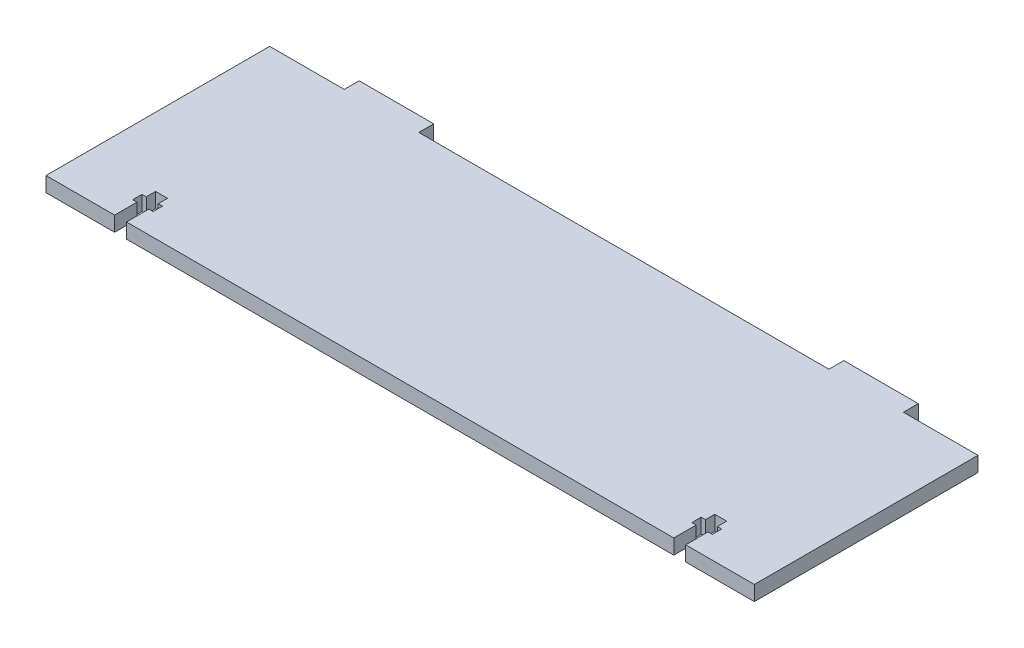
ISO-10303-21;
HEADER;
FILE_DESCRIPTION(('STEP AP214'),'2;1');
FILE_NAME('part.step','',(''),(''),'','','');
FILE_SCHEMA(('AUTOMOTIVE_DESIGN { 1 0 10303 214 1 1 1 1 }'));
ENDSEC;
DATA;
#1=APPLICATION_CONTEXT('core data for automotive mechanical design processes');
#2=APPLICATION_PROTOCOL_DEFINITION('international standard','automotive_design',2000,#1);
#3=PRODUCT_CONTEXT('',#1,'mechanical');
#4=PRODUCT('Part','Part','',(#3));
#5=PRODUCT_RELATED_PRODUCT_CATEGORY('part','',(#4));
#6=PRODUCT_DEFINITION_FORMATION('','',#4);
#7=PRODUCT_DEFINITION_CONTEXT('part definition',#1,'design');
#8=PRODUCT_DEFINITION('design','',#6,#7);
#9=PRODUCT_DEFINITION_SHAPE('','',#8);
#10=(LENGTH_UNIT() NAMED_UNIT(*) SI_UNIT(.MILLI.,.METRE.));
#11=(NAMED_UNIT(*) PLANE_ANGLE_UNIT() SI_UNIT($,.RADIAN.));
#12=(NAMED_UNIT(*) SI_UNIT($,.STERADIAN.) SOLID_ANGLE_UNIT());
#13=UNCERTAINTY_MEASURE_WITH_UNIT(LENGTH_MEASURE(1.E-05),#10,'distance_accuracy_value','');
#14=(GEOMETRIC_REPRESENTATION_CONTEXT(3) GLOBAL_UNCERTAINTY_ASSIGNED_CONTEXT((#13)) GLOBAL_UNIT_ASSIGNED_CONTEXT((#10,
#11,#12)) REPRESENTATION_CONTEXT('',''));
#15=CARTESIAN_POINT('',(0.,0.,0.));
#16=DIRECTION('',(0.,0.,1.));
#17=DIRECTION('',(1.,0.,0.));
#18=AXIS2_PLACEMENT_3D('',#15,#16,#17);
#19=CARTESIAN_POINT('',(-95.,4.,-30.));
#20=DIRECTION('',(1.,0.,0.));
#21=DIRECTION('',(0.,0.,-1.));
#22=AXIS2_PLACEMENT_3D('',#19,#20,#21);
#23=PLANE('',#22);
#24=DIRECTION('',(0.,0.,1.));
#25=VECTOR('',#24,1.);
#26=CARTESIAN_POINT('',(-95.,0.,-30.));
#27=LINE('',#26,#25);
#28=CARTESIAN_POINT('',(-95.,0.,-30.));
#29=VERTEX_POINT('',#28);
#30=CARTESIAN_POINT('',(-95.,0.,30.));
#31=VERTEX_POINT('',#30);
#32=EDGE_CURVE('E297',#29,#31,#27,.T.);
#33=ORIENTED_EDGE('',*,*,#32,.T.);
#34=DIRECTION('',(0.,-1.,0.));
#35=VECTOR('',#34,1.);
#36=CARTESIAN_POINT('',(-95.,4.,30.));
#37=LINE('',#36,#35);
#38=CARTESIAN_POINT('',(-95.,4.,30.));
#39=VERTEX_POINT('',#38);
#40=EDGE_CURVE('E11',#39,#31,#37,.T.);
#41=ORIENTED_EDGE('',*,*,#40,.F.);
#42=DIRECTION('',(0.,0.,1.));
#43=VECTOR('',#42,1.);
#44=CARTESIAN_POINT('',(-95.,4.,-30.));
#45=LINE('',#44,#43);
#46=CARTESIAN_POINT('',(-95.,4.,-30.));
#47=VERTEX_POINT('',#46);
#48=EDGE_CURVE('E367',#47,#39,#45,.T.);
#49=ORIENTED_EDGE('',*,*,#48,.F.);
#50=DIRECTION('',(0.,-1.,0.));
#51=VECTOR('',#50,1.);
#52=CARTESIAN_POINT('',(-95.,4.,-30.));
#53=LINE('',#52,#51);
#54=EDGE_CURVE('E293',#47,#29,#53,.T.);
#55=ORIENTED_EDGE('',*,*,#54,.T.);
#56=EDGE_LOOP('',(#33,#41,#49,#55));
#57=FACE_BOUND('',#56,.T.);
#58=ADVANCED_FACE('F33',(#57),#23,.F.);
#59=CARTESIAN_POINT('',(-95.,4.,30.));
#60=DIRECTION('',(0.,0.,-1.));
#61=DIRECTION('',(-1.,0.,0.));
#62=AXIS2_PLACEMENT_3D('',#59,#60,#61);
#63=PLANE('',#62);
#64=DIRECTION('',(1.,0.,0.));
#65=VECTOR('',#64,1.);
#66=CARTESIAN_POINT('',(-95.,0.,30.));
#67=LINE('',#66,#65);
#68=CARTESIAN_POINT('',(-76.6,0.,30.));
#69=VERTEX_POINT('',#68);
#70=EDGE_CURVE('E300',#31,#69,#67,.T.);
#71=ORIENTED_EDGE('',*,*,#70,.T.);
#72=DIRECTION('',(0.,-1.,0.));
#73=VECTOR('',#72,1.);
#74=CARTESIAN_POINT('',(-76.6,4.,30.));
#75=LINE('',#74,#73);
#76=CARTESIAN_POINT('',(-76.6,4.,30.));
#77=VERTEX_POINT('',#76);
#78=EDGE_CURVE('E41',#77,#69,#75,.T.);
#79=ORIENTED_EDGE('',*,*,#78,.F.);
#80=DIRECTION('',(1.,0.,0.));
#81=VECTOR('',#80,1.);
#82=CARTESIAN_POINT('',(-95.,4.,30.));
#83=LINE('',#82,#81);
#84=EDGE_CURVE('E176',#39,#77,#83,.T.);
#85=ORIENTED_EDGE('',*,*,#84,.F.);
#86=ORIENTED_EDGE('',*,*,#40,.T.);
#87=EDGE_LOOP('',(#71,#79,#85,#86));
#88=FACE_BOUND('',#87,.T.);
#89=ADVANCED_FACE('F565',(#88),#63,.F.);
#90=CARTESIAN_POINT('',(-76.6,4.,24.));
#91=DIRECTION('',(-1.,0.,0.));
#92=DIRECTION('',(0.,0.,1.));
#93=AXIS2_PLACEMENT_3D('',#90,#91,#92);
#94=PLANE('',#93);
#95=DIRECTION('',(0.,0.,-1.));
#96=VECTOR('',#95,1.);
#97=CARTESIAN_POINT('',(-76.6,0.,24.));
#98=LINE('',#97,#96);
#99=CARTESIAN_POINT('',(-76.6,0.,24.));
#100=VERTEX_POINT('',#99);
#101=EDGE_CURVE('E302',#69,#100,#98,.T.);
#102=ORIENTED_EDGE('',*,*,#101,.T.);
#103=DIRECTION('',(0.,-1.,0.));
#104=VECTOR('',#103,1.);
#105=CARTESIAN_POINT('',(-76.6,4.,24.));
#106=LINE('',#105,#104);
#107=CARTESIAN_POINT('',(-76.6,4.,24.));
#108=VERTEX_POINT('',#107);
#109=EDGE_CURVE('E458',#108,#100,#106,.T.);
#110=ORIENTED_EDGE('',*,*,#109,.F.);
#111=DIRECTION('',(0.,0.,-1.));
#112=VECTOR('',#111,1.);
#113=CARTESIAN_POINT('',(-76.6,4.,24.));
#114=LINE('',#113,#112);
#115=EDGE_CURVE('E466',#77,#108,#114,.T.);
#116=ORIENTED_EDGE('',*,*,#115,.F.);
#117=ORIENTED_EDGE('',*,*,#78,.T.);
#118=EDGE_LOOP('',(#102,#110,#116,#117));
#119=FACE_BOUND('',#118,.T.);
#120=ADVANCED_FACE('F464',(#119),#94,.F.);
#121=CARTESIAN_POINT('',(-77.75,4.,24.));
#122=DIRECTION('',(0.,0.,1.));
#123=DIRECTION('',(1.,0.,0.));
#124=AXIS2_PLACEMENT_3D('',#121,#122,#123);
#125=PLANE('',#124);
#126=DIRECTION('',(-1.,0.,0.));
#127=VECTOR('',#126,1.);
#128=CARTESIAN_POINT('',(-77.75,0.,24.));
#129=LINE('',#128,#127);
#130=CARTESIAN_POINT('',(-77.75,0.,24.));
#131=VERTEX_POINT('',#130);
#132=EDGE_CURVE('E304',#100,#131,#129,.T.);
#133=ORIENTED_EDGE('',*,*,#132,.T.);
#134=DIRECTION('',(0.,-1.,0.));
#135=VECTOR('',#134,1.);
#136=CARTESIAN_POINT('',(-77.75,4.,24.));
#137=LINE('',#136,#135);
#138=CARTESIAN_POINT('',(-77.75,4.,24.));
#139=VERTEX_POINT('',#138);
#140=EDGE_CURVE('E455',#139,#131,#137,.T.);
#141=ORIENTED_EDGE('',*,*,#140,.F.);
#142=DIRECTION('',(-1.,0.,0.));
#143=VECTOR('',#142,1.);
#144=CARTESIAN_POINT('',(-77.75,4.,24.));
#145=LINE('',#144,#143);
#146=EDGE_CURVE('E484',#108,#139,#145,.T.);
#147=ORIENTED_EDGE('',*,*,#146,.F.);
#148=ORIENTED_EDGE('',*,*,#109,.T.);
#149=EDGE_LOOP('',(#133,#141,#147,#148));
#150=FACE_BOUND('',#149,.T.);
#151=ADVANCED_FACE('F475',(#150),#125,.F.);
#152=CARTESIAN_POINT('',(-77.75,4.,21.5));
#153=DIRECTION('',(-1.,0.,0.));
#154=DIRECTION('',(0.,0.,1.));
#155=AXIS2_PLACEMENT_3D('',#152,#153,#154);
#156=PLANE('',#155);
#157=DIRECTION('',(0.,0.,-1.));
#158=VECTOR('',#157,1.);
#159=CARTESIAN_POINT('',(-77.75,0.,21.5));
#160=LINE('',#159,#158);
#161=CARTESIAN_POINT('',(-77.75,0.,21.5));
#162=VERTEX_POINT('',#161);
#163=EDGE_CURVE('E306',#131,#162,#160,.T.);
#164=ORIENTED_EDGE('',*,*,#163,.T.);
#165=DIRECTION('',(0.,-1.,0.));
#166=VECTOR('',#165,1.);
#167=CARTESIAN_POINT('',(-77.75,4.,21.5));
#168=LINE('',#167,#166);
#169=CARTESIAN_POINT('',(-77.75,4.,21.5));
#170=VERTEX_POINT('',#169);
#171=EDGE_CURVE('E452',#170,#162,#168,.T.);
#172=ORIENTED_EDGE('',*,*,#171,.F.);
#173=DIRECTION('',(0.,0.,-1.));
#174=VECTOR('',#173,1.);
#175=CARTESIAN_POINT('',(-77.75,4.,21.5));
#176=LINE('',#175,#174);
#177=EDGE_CURVE('E481',#139,#170,#176,.T.);
#178=ORIENTED_EDGE('',*,*,#177,.F.);
#179=ORIENTED_EDGE('',*,*,#140,.T.);
#180=EDGE_LOOP('',(#164,#172,#178,#179));
#181=FACE_BOUND('',#180,.T.);
#182=ADVANCED_FACE('F479',(#181),#156,.F.);
#183=CARTESIAN_POINT('',(-77.75,4.,21.5));
#184=DIRECTION('',(0.,0.,-1.));
#185=DIRECTION('',(-1.,0.,0.));
#186=AXIS2_PLACEMENT_3D('',#183,#184,#185);
#187=PLANE('',#186);
#188=DIRECTION('',(1.,0.,0.));
#189=VECTOR('',#188,1.);
#190=CARTESIAN_POINT('',(-77.75,0.,21.5));
#191=LINE('',#190,#189);
#192=CARTESIAN_POINT('',(-76.6,0.,21.5));
#193=VERTEX_POINT('',#192);
#194=EDGE_CURVE('E308',#162,#193,#191,.T.);
#195=ORIENTED_EDGE('',*,*,#194,.T.);
#196=DIRECTION('',(0.,-1.,0.));
#197=VECTOR('',#196,1.);
#198=CARTESIAN_POINT('',(-76.6,4.,21.5));
#199=LINE('',#198,#197);
#200=CARTESIAN_POINT('',(-76.6,4.,21.5));
#201=VERTEX_POINT('',#200);
#202=EDGE_CURVE('E449',#201,#193,#199,.T.);
#203=ORIENTED_EDGE('',*,*,#202,.F.);
#204=DIRECTION('',(1.,0.,0.));
#205=VECTOR('',#204,1.);
#206=CARTESIAN_POINT('',(-77.75,4.,21.5));
#207=LINE('',#206,#205);
#208=EDGE_CURVE('E483',#170,#201,#207,.T.);
#209=ORIENTED_EDGE('',*,*,#208,.F.);
#210=ORIENTED_EDGE('',*,*,#171,.T.);
#211=EDGE_LOOP('',(#195,#203,#209,#210));
#212=FACE_BOUND('',#211,.T.);
#213=ADVANCED_FACE('F578',(#212),#187,.F.);
#214=CARTESIAN_POINT('',(-76.6,4.,19.));
#215=DIRECTION('',(-1.,0.,0.));
#216=DIRECTION('',(0.,0.,1.));
#217=AXIS2_PLACEMENT_3D('',#214,#215,#216);
#218=PLANE('',#217);
#219=DIRECTION('',(0.,0.,-1.));
#220=VECTOR('',#219,1.);
#221=CARTESIAN_POINT('',(-76.6,0.,19.));
#222=LINE('',#221,#220);
#223=CARTESIAN_POINT('',(-76.6,0.,19.));
#224=VERTEX_POINT('',#223);
#225=EDGE_CURVE('E310',#193,#224,#222,.T.);
#226=ORIENTED_EDGE('',*,*,#225,.T.);
#227=DIRECTION('',(0.,-1.,0.));
#228=VECTOR('',#227,1.);
#229=CARTESIAN_POINT('',(-76.6,4.,19.));
#230=LINE('',#229,#228);
#231=CARTESIAN_POINT('',(-76.6,4.,19.));
#232=VERTEX_POINT('',#231);
#233=EDGE_CURVE('E446',#232,#224,#230,.T.);
#234=ORIENTED_EDGE('',*,*,#233,.F.);
#235=DIRECTION('',(0.,0.,-1.));
#236=VECTOR('',#235,1.);
#237=CARTESIAN_POINT('',(-76.6,4.,19.));
#238=LINE('',#237,#236);
#239=EDGE_CURVE('E486',#201,#232,#238,.T.);
#240=ORIENTED_EDGE('',*,*,#239,.F.);
#241=ORIENTED_EDGE('',*,*,#202,.T.);
#242=EDGE_LOOP('',(#226,#234,#240,#241));
#243=FACE_BOUND('',#242,.T.);
#244=ADVANCED_FACE('F581',(#243),#218,.F.);
#245=CARTESIAN_POINT('',(-76.6,4.,19.));
#246=DIRECTION('',(0.,0.,-1.));
#247=DIRECTION('',(-1.,0.,0.));
#248=AXIS2_PLACEMENT_3D('',#245,#246,#247);
#249=PLANE('',#248);
#250=DIRECTION('',(1.,0.,0.));
#251=VECTOR('',#250,1.);
#252=CARTESIAN_POINT('',(-76.6,0.,19.));
#253=LINE('',#252,#251);
#254=CARTESIAN_POINT('',(-73.4,0.,19.));
#255=VERTEX_POINT('',#254);
#256=EDGE_CURVE('E312',#224,#255,#253,.T.);
#257=ORIENTED_EDGE('',*,*,#256,.T.);
#258=DIRECTION('',(0.,-1.,0.));
#259=VECTOR('',#258,1.);
#260=CARTESIAN_POINT('',(-73.4,4.,19.));
#261=LINE('',#260,#259);
#262=CARTESIAN_POINT('',(-73.4,4.,19.));
#263=VERTEX_POINT('',#262);
#264=EDGE_CURVE('E443',#263,#255,#261,.T.);
#265=ORIENTED_EDGE('',*,*,#264,.F.);
#266=DIRECTION('',(1.,0.,0.));
#267=VECTOR('',#266,1.);
#268=CARTESIAN_POINT('',(-76.6,4.,19.));
#269=LINE('',#268,#267);
#270=EDGE_CURVE('E492',#232,#263,#269,.T.);
#271=ORIENTED_EDGE('',*,*,#270,.F.);
#272=ORIENTED_EDGE('',*,*,#233,.T.);
#273=EDGE_LOOP('',(#257,#265,#271,#272));
#274=FACE_BOUND('',#273,.T.);
#275=ADVANCED_FACE('F585',(#274),#249,.F.);
#276=CARTESIAN_POINT('',(-73.4,4.,19.));
#277=DIRECTION('',(1.,0.,0.));
#278=DIRECTION('',(0.,0.,-1.));
#279=AXIS2_PLACEMENT_3D('',#276,#277,#278);
#280=PLANE('',#279);
#281=DIRECTION('',(0.,0.,1.));
#282=VECTOR('',#281,1.);
#283=CARTESIAN_POINT('',(-73.4,0.,19.));
#284=LINE('',#283,#282);
#285=CARTESIAN_POINT('',(-73.4,0.,21.5));
#286=VERTEX_POINT('',#285);
#287=EDGE_CURVE('E314',#255,#286,#284,.T.);
#288=ORIENTED_EDGE('',*,*,#287,.T.);
#289=DIRECTION('',(0.,-1.,0.));
#290=VECTOR('',#289,1.);
#291=CARTESIAN_POINT('',(-73.4,4.,21.5));
#292=LINE('',#291,#290);
#293=CARTESIAN_POINT('',(-73.4,4.,21.5));
#294=VERTEX_POINT('',#293);
#295=EDGE_CURVE('E440',#294,#286,#292,.T.);
#296=ORIENTED_EDGE('',*,*,#295,.F.);
#297=DIRECTION('',(0.,0.,1.));
#298=VECTOR('',#297,1.);
#299=CARTESIAN_POINT('',(-73.4,4.,19.));
#300=LINE('',#299,#298);
#301=EDGE_CURVE('E494',#263,#294,#300,.T.);
#302=ORIENTED_EDGE('',*,*,#301,.F.);
#303=ORIENTED_EDGE('',*,*,#264,.T.);
#304=EDGE_LOOP('',(#288,#296,#302,#303));
#305=FACE_BOUND('',#304,.T.);
#306=ADVANCED_FACE('F589',(#305),#280,.F.);
#307=CARTESIAN_POINT('',(-73.4,4.,21.5));
#308=DIRECTION('',(0.,0.,-1.));
#309=DIRECTION('',(-1.,0.,0.));
#310=AXIS2_PLACEMENT_3D('',#307,#308,#309);
#311=PLANE('',#310);
#312=DIRECTION('',(1.,0.,0.));
#313=VECTOR('',#312,1.);
#314=CARTESIAN_POINT('',(-73.4,0.,21.5));
#315=LINE('',#314,#313);
#316=CARTESIAN_POINT('',(-72.25,0.,21.5));
#317=VERTEX_POINT('',#316);
#318=EDGE_CURVE('E316',#286,#317,#315,.T.);
#319=ORIENTED_EDGE('',*,*,#318,.T.);
#320=DIRECTION('',(0.,-1.,0.));
#321=VECTOR('',#320,1.);
#322=CARTESIAN_POINT('',(-72.25,4.,21.5));
#323=LINE('',#322,#321);
#324=CARTESIAN_POINT('',(-72.25,4.,21.5));
#325=VERTEX_POINT('',#324);
#326=EDGE_CURVE('E437',#325,#317,#323,.T.);
#327=ORIENTED_EDGE('',*,*,#326,.F.);
#328=DIRECTION('',(1.,0.,0.));
#329=VECTOR('',#328,1.);
#330=CARTESIAN_POINT('',(-73.4,4.,21.5));
#331=LINE('',#330,#329);
#332=EDGE_CURVE('E496',#294,#325,#331,.T.);
#333=ORIENTED_EDGE('',*,*,#332,.F.);
#334=ORIENTED_EDGE('',*,*,#295,.T.);
#335=EDGE_LOOP('',(#319,#327,#333,#334));
#336=FACE_BOUND('',#335,.T.);
#337=ADVANCED_FACE('F593',(#336),#311,.F.);
#338=CARTESIAN_POINT('',(-72.25,4.,21.5));
#339=DIRECTION('',(1.,0.,0.));
#340=DIRECTION('',(0.,0.,-1.));
#341=AXIS2_PLACEMENT_3D('',#338,#339,#340);
#342=PLANE('',#341);
#343=DIRECTION('',(0.,0.,1.));
#344=VECTOR('',#343,1.);
#345=CARTESIAN_POINT('',(-72.25,0.,21.5));
#346=LINE('',#345,#344);
#347=CARTESIAN_POINT('',(-72.25,0.,24.));
#348=VERTEX_POINT('',#347);
#349=EDGE_CURVE('E318',#317,#348,#346,.T.);
#350=ORIENTED_EDGE('',*,*,#349,.T.);
#351=DIRECTION('',(0.,-1.,0.));
#352=VECTOR('',#351,1.);
#353=CARTESIAN_POINT('',(-72.25,4.,24.));
#354=LINE('',#353,#352);
#355=CARTESIAN_POINT('',(-72.25,4.,24.));
#356=VERTEX_POINT('',#355);
#357=EDGE_CURVE('E434',#356,#348,#354,.T.);
#358=ORIENTED_EDGE('',*,*,#357,.F.);
#359=DIRECTION('',(0.,0.,1.));
#360=VECTOR('',#359,1.);
#361=CARTESIAN_POINT('',(-72.25,4.,21.5));
#362=LINE('',#361,#360);
#363=EDGE_CURVE('E498',#325,#356,#362,.T.);
#364=ORIENTED_EDGE('',*,*,#363,.F.);
#365=ORIENTED_EDGE('',*,*,#326,.T.);
#366=EDGE_LOOP('',(#350,#358,#364,#365));
#367=FACE_BOUND('',#366,.T.);
#368=ADVANCED_FACE('F597',(#367),#342,.F.);
#369=CARTESIAN_POINT('',(-73.4,4.,24.));
#370=DIRECTION('',(0.,0.,1.));
#371=DIRECTION('',(1.,0.,0.));
#372=AXIS2_PLACEMENT_3D('',#369,#370,#371);
#373=PLANE('',#372);
#374=DIRECTION('',(-1.,0.,0.));
#375=VECTOR('',#374,1.);
#376=CARTESIAN_POINT('',(-73.4,0.,24.));
#377=LINE('',#376,#375);
#378=CARTESIAN_POINT('',(-73.4,0.,24.));
#379=VERTEX_POINT('',#378);
#380=EDGE_CURVE('E320',#348,#379,#377,.T.);
#381=ORIENTED_EDGE('',*,*,#380,.T.);
#382=DIRECTION('',(0.,-1.,0.));
#383=VECTOR('',#382,1.);
#384=CARTESIAN_POINT('',(-73.4,4.,24.));
#385=LINE('',#384,#383);
#386=CARTESIAN_POINT('',(-73.4,4.,24.));
#387=VERTEX_POINT('',#386);
#388=EDGE_CURVE('E431',#387,#379,#385,.T.);
#389=ORIENTED_EDGE('',*,*,#388,.F.);
#390=DIRECTION('',(-1.,0.,0.));
#391=VECTOR('',#390,1.);
#392=CARTESIAN_POINT('',(-73.4,4.,24.));
#393=LINE('',#392,#391);
#394=EDGE_CURVE('E500',#356,#387,#393,.T.);
#395=ORIENTED_EDGE('',*,*,#394,.F.);
#396=ORIENTED_EDGE('',*,*,#357,.T.);
#397=EDGE_LOOP('',(#381,#389,#395,#396));
#398=FACE_BOUND('',#397,.T.);
#399=ADVANCED_FACE('F601',(#398),#373,.F.);
#400=CARTESIAN_POINT('',(-73.4,4.,24.));
#401=DIRECTION('',(1.,0.,0.));
#402=DIRECTION('',(0.,0.,-1.));
#403=AXIS2_PLACEMENT_3D('',#400,#401,#402);
#404=PLANE('',#403);
#405=DIRECTION('',(0.,0.,1.));
#406=VECTOR('',#405,1.);
#407=CARTESIAN_POINT('',(-73.4,0.,24.));
#408=LINE('',#407,#406);
#409=CARTESIAN_POINT('',(-73.4,0.,30.));
#410=VERTEX_POINT('',#409);
#411=EDGE_CURVE('E322',#379,#410,#408,.T.);
#412=ORIENTED_EDGE('',*,*,#411,.T.);
#413=DIRECTION('',(0.,-1.,0.));
#414=VECTOR('',#413,1.);
#415=CARTESIAN_POINT('',(-73.4,4.,30.));
#416=LINE('',#415,#414);
#417=CARTESIAN_POINT('',(-73.4,4.,30.));
#418=VERTEX_POINT('',#417);
#419=EDGE_CURVE('E428',#418,#410,#416,.T.);
#420=ORIENTED_EDGE('',*,*,#419,.F.);
#421=DIRECTION('',(0.,0.,1.));
#422=VECTOR('',#421,1.);
#423=CARTESIAN_POINT('',(-73.4,4.,24.));
#424=LINE('',#423,#422);
#425=EDGE_CURVE('E502',#387,#418,#424,.T.);
#426=ORIENTED_EDGE('',*,*,#425,.F.);
#427=ORIENTED_EDGE('',*,*,#388,.T.);
#428=EDGE_LOOP('',(#412,#420,#426,#427));
#429=FACE_BOUND('',#428,.T.);
#430=ADVANCED_FACE('F605',(#429),#404,.F.);
#431=CARTESIAN_POINT('',(-73.4,4.,30.));
#432=DIRECTION('',(0.,0.,-1.));
#433=DIRECTION('',(-1.,0.,0.));
#434=AXIS2_PLACEMENT_3D('',#431,#432,#433);
#435=PLANE('',#434);
#436=DIRECTION('',(1.,0.,0.));
#437=VECTOR('',#436,1.);
#438=CARTESIAN_POINT('',(-73.4,0.,30.));
#439=LINE('',#438,#437);
#440=CARTESIAN_POINT('',(73.4,0.,30.));
#441=VERTEX_POINT('',#440);
#442=EDGE_CURVE('E324',#410,#441,#439,.T.);
#443=ORIENTED_EDGE('',*,*,#442,.T.);
#444=DIRECTION('',(0.,-1.,0.));
#445=VECTOR('',#444,1.);
#446=CARTESIAN_POINT('',(73.4,4.,30.));
#447=LINE('',#446,#445);
#448=CARTESIAN_POINT('',(73.4,4.,30.));
#449=VERTEX_POINT('',#448);
#450=EDGE_CURVE('E425',#449,#441,#447,.T.);
#451=ORIENTED_EDGE('',*,*,#450,.F.);
#452=DIRECTION('',(1.,0.,0.));
#453=VECTOR('',#452,1.);
#454=CARTESIAN_POINT('',(-73.4,4.,30.));
#455=LINE('',#454,#453);
#456=EDGE_CURVE('E504',#418,#449,#455,.T.);
#457=ORIENTED_EDGE('',*,*,#456,.F.);
#458=ORIENTED_EDGE('',*,*,#419,.T.);
#459=EDGE_LOOP('',(#443,#451,#457,#458));
#460=FACE_BOUND('',#459,.T.);
#461=ADVANCED_FACE('F609',(#460),#435,.F.);
#462=CARTESIAN_POINT('',(73.4,4.,24.));
#463=DIRECTION('',(-1.,0.,0.));
#464=DIRECTION('',(0.,0.,1.));
#465=AXIS2_PLACEMENT_3D('',#462,#463,#464);
#466=PLANE('',#465);
#467=DIRECTION('',(0.,0.,-1.));
#468=VECTOR('',#467,1.);
#469=CARTESIAN_POINT('',(73.4,0.,24.));
#470=LINE('',#469,#468);
#471=CARTESIAN_POINT('',(73.4,0.,24.));
#472=VERTEX_POINT('',#471);
#473=EDGE_CURVE('E326',#441,#472,#470,.T.);
#474=ORIENTED_EDGE('',*,*,#473,.T.);
#475=DIRECTION('',(0.,-1.,0.));
#476=VECTOR('',#475,1.);
#477=CARTESIAN_POINT('',(73.4,4.,24.));
#478=LINE('',#477,#476);
#479=CARTESIAN_POINT('',(73.4,4.,24.));
#480=VERTEX_POINT('',#479);
#481=EDGE_CURVE('E422',#480,#472,#478,.T.);
#482=ORIENTED_EDGE('',*,*,#481,.F.);
#483=DIRECTION('',(0.,0.,-1.));
#484=VECTOR('',#483,1.);
#485=CARTESIAN_POINT('',(73.4,4.,24.));
#486=LINE('',#485,#484);
#487=EDGE_CURVE('E506',#449,#480,#486,.T.);
#488=ORIENTED_EDGE('',*,*,#487,.F.);
#489=ORIENTED_EDGE('',*,*,#450,.T.);
#490=EDGE_LOOP('',(#474,#482,#488,#489));
#491=FACE_BOUND('',#490,.T.);
#492=ADVANCED_FACE('F613',(#491),#466,.F.);
#493=CARTESIAN_POINT('',(73.4,4.,24.));
#494=DIRECTION('',(0.,0.,1.));
#495=DIRECTION('',(1.,0.,0.));
#496=AXIS2_PLACEMENT_3D('',#493,#494,#495);
#497=PLANE('',#496);
#498=DIRECTION('',(-1.,0.,0.));
#499=VECTOR('',#498,1.);
#500=CARTESIAN_POINT('',(73.4,0.,24.));
#501=LINE('',#500,#499);
#502=CARTESIAN_POINT('',(72.25,0.,24.));
#503=VERTEX_POINT('',#502);
#504=EDGE_CURVE('E328',#472,#503,#501,.T.);
#505=ORIENTED_EDGE('',*,*,#504,.T.);
#506=DIRECTION('',(0.,-1.,0.));
#507=VECTOR('',#506,1.);
#508=CARTESIAN_POINT('',(72.25,4.,24.));
#509=LINE('',#508,#507);
#510=CARTESIAN_POINT('',(72.25,4.,24.));
#511=VERTEX_POINT('',#510);
#512=EDGE_CURVE('E419',#511,#503,#509,.T.);
#513=ORIENTED_EDGE('',*,*,#512,.F.);
#514=DIRECTION('',(-1.,0.,0.));
#515=VECTOR('',#514,1.);
#516=CARTESIAN_POINT('',(73.4,4.,24.));
#517=LINE('',#516,#515);
#518=EDGE_CURVE('E508',#480,#511,#517,.T.);
#519=ORIENTED_EDGE('',*,*,#518,.F.);
#520=ORIENTED_EDGE('',*,*,#481,.T.);
#521=EDGE_LOOP('',(#505,#513,#519,#520));
#522=FACE_BOUND('',#521,.T.);
#523=ADVANCED_FACE('F617',(#522),#497,.F.);
#524=CARTESIAN_POINT('',(72.25,4.,21.5));
#525=DIRECTION('',(-1.,0.,0.));
#526=DIRECTION('',(0.,0.,1.));
#527=AXIS2_PLACEMENT_3D('',#524,#525,#526);
#528=PLANE('',#527);
#529=DIRECTION('',(0.,0.,-1.));
#530=VECTOR('',#529,1.);
#531=CARTESIAN_POINT('',(72.25,0.,21.5));
#532=LINE('',#531,#530);
#533=CARTESIAN_POINT('',(72.25,0.,21.5));
#534=VERTEX_POINT('',#533);
#535=EDGE_CURVE('E330',#503,#534,#532,.T.);
#536=ORIENTED_EDGE('',*,*,#535,.T.);
#537=DIRECTION('',(0.,-1.,0.));
#538=VECTOR('',#537,1.);
#539=CARTESIAN_POINT('',(72.25,4.,21.5));
#540=LINE('',#539,#538);
#541=CARTESIAN_POINT('',(72.25,4.,21.5));
#542=VERTEX_POINT('',#541);
#543=EDGE_CURVE('E416',#542,#534,#540,.T.);
#544=ORIENTED_EDGE('',*,*,#543,.F.);
#545=DIRECTION('',(0.,0.,-1.));
#546=VECTOR('',#545,1.);
#547=CARTESIAN_POINT('',(72.25,4.,21.5));
#548=LINE('',#547,#546);
#549=EDGE_CURVE('E510',#511,#542,#548,.T.);
#550=ORIENTED_EDGE('',*,*,#549,.F.);
#551=ORIENTED_EDGE('',*,*,#512,.T.);
#552=EDGE_LOOP('',(#536,#544,#550,#551));
#553=FACE_BOUND('',#552,.T.);
#554=ADVANCED_FACE('F621',(#553),#528,.F.);
#555=CARTESIAN_POINT('',(73.4,4.,21.5));
#556=DIRECTION('',(0.,0.,-1.));
#557=DIRECTION('',(-1.,0.,0.));
#558=AXIS2_PLACEMENT_3D('',#555,#556,#557);
#559=PLANE('',#558);
#560=DIRECTION('',(1.,0.,0.));
#561=VECTOR('',#560,1.);
#562=CARTESIAN_POINT('',(73.4,0.,21.5));
#563=LINE('',#562,#561);
#564=CARTESIAN_POINT('',(73.4,0.,21.5));
#565=VERTEX_POINT('',#564);
#566=EDGE_CURVE('E332',#534,#565,#563,.T.);
#567=ORIENTED_EDGE('',*,*,#566,.T.);
#568=DIRECTION('',(0.,-1.,0.));
#569=VECTOR('',#568,1.);
#570=CARTESIAN_POINT('',(73.4,4.,21.5));
#571=LINE('',#570,#569);
#572=CARTESIAN_POINT('',(73.4,4.,21.5));
#573=VERTEX_POINT('',#572);
#574=EDGE_CURVE('E413',#573,#565,#571,.T.);
#575=ORIENTED_EDGE('',*,*,#574,.F.);
#576=DIRECTION('',(1.,0.,0.));
#577=VECTOR('',#576,1.);
#578=CARTESIAN_POINT('',(73.4,4.,21.5));
#579=LINE('',#578,#577);
#580=EDGE_CURVE('E512',#542,#573,#579,.T.);
#581=ORIENTED_EDGE('',*,*,#580,.F.);
#582=ORIENTED_EDGE('',*,*,#543,.T.);
#583=EDGE_LOOP('',(#567,#575,#581,#582));
#584=FACE_BOUND('',#583,.T.);
#585=ADVANCED_FACE('F625',(#584),#559,.F.);
#586=CARTESIAN_POINT('',(73.4,4.,19.));
#587=DIRECTION('',(-1.,0.,0.));
#588=DIRECTION('',(0.,0.,1.));
#589=AXIS2_PLACEMENT_3D('',#586,#587,#588);
#590=PLANE('',#589);
#591=DIRECTION('',(0.,0.,-1.));
#592=VECTOR('',#591,1.);
#593=CARTESIAN_POINT('',(73.4,0.,19.));
#594=LINE('',#593,#592);
#595=CARTESIAN_POINT('',(73.4,0.,19.));
#596=VERTEX_POINT('',#595);
#597=EDGE_CURVE('E334',#565,#596,#594,.T.);
#598=ORIENTED_EDGE('',*,*,#597,.T.);
#599=DIRECTION('',(0.,-1.,0.));
#600=VECTOR('',#599,1.);
#601=CARTESIAN_POINT('',(73.4,4.,19.));
#602=LINE('',#601,#600);
#603=CARTESIAN_POINT('',(73.4,4.,19.));
#604=VERTEX_POINT('',#603);
#605=EDGE_CURVE('E410',#604,#596,#602,.T.);
#606=ORIENTED_EDGE('',*,*,#605,.F.);
#607=DIRECTION('',(0.,0.,-1.));
#608=VECTOR('',#607,1.);
#609=CARTESIAN_POINT('',(73.4,4.,19.));
#610=LINE('',#609,#608);
#611=EDGE_CURVE('E514',#573,#604,#610,.T.);
#612=ORIENTED_EDGE('',*,*,#611,.F.);
#613=ORIENTED_EDGE('',*,*,#574,.T.);
#614=EDGE_LOOP('',(#598,#606,#612,#613));
#615=FACE_BOUND('',#614,.T.);
#616=ADVANCED_FACE('F629',(#615),#590,.F.);
#617=CARTESIAN_POINT('',(76.6,4.,19.));
#618=DIRECTION('',(0.,0.,-1.));
#619=DIRECTION('',(-1.,0.,0.));
#620=AXIS2_PLACEMENT_3D('',#617,#618,#619);
#621=PLANE('',#620);
#622=DIRECTION('',(1.,0.,0.));
#623=VECTOR('',#622,1.);
#624=CARTESIAN_POINT('',(76.6,0.,19.));
#625=LINE('',#624,#623);
#626=CARTESIAN_POINT('',(76.6,0.,19.));
#627=VERTEX_POINT('',#626);
#628=EDGE_CURVE('E336',#596,#627,#625,.T.);
#629=ORIENTED_EDGE('',*,*,#628,.T.);
#630=DIRECTION('',(0.,-1.,0.));
#631=VECTOR('',#630,1.);
#632=CARTESIAN_POINT('',(76.6,4.,19.));
#633=LINE('',#632,#631);
#634=CARTESIAN_POINT('',(76.6,4.,19.));
#635=VERTEX_POINT('',#634);
#636=EDGE_CURVE('E407',#635,#627,#633,.T.);
#637=ORIENTED_EDGE('',*,*,#636,.F.);
#638=DIRECTION('',(1.,0.,0.));
#639=VECTOR('',#638,1.);
#640=CARTESIAN_POINT('',(76.6,4.,19.));
#641=LINE('',#640,#639);
#642=EDGE_CURVE('E516',#604,#635,#641,.T.);
#643=ORIENTED_EDGE('',*,*,#642,.F.);
#644=ORIENTED_EDGE('',*,*,#605,.T.);
#645=EDGE_LOOP('',(#629,#637,#643,#644));
#646=FACE_BOUND('',#645,.T.);
#647=ADVANCED_FACE('F633',(#646),#621,.F.);
#648=CARTESIAN_POINT('',(76.6,4.,19.));
#649=DIRECTION('',(1.,0.,0.));
#650=DIRECTION('',(0.,0.,-1.));
#651=AXIS2_PLACEMENT_3D('',#648,#649,#650);
#652=PLANE('',#651);
#653=DIRECTION('',(0.,0.,1.));
#654=VECTOR('',#653,1.);
#655=CARTESIAN_POINT('',(76.6,0.,19.));
#656=LINE('',#655,#654);
#657=CARTESIAN_POINT('',(76.6,0.,21.5));
#658=VERTEX_POINT('',#657);
#659=EDGE_CURVE('E338',#627,#658,#656,.T.);
#660=ORIENTED_EDGE('',*,*,#659,.T.);
#661=DIRECTION('',(0.,-1.,0.));
#662=VECTOR('',#661,1.);
#663=CARTESIAN_POINT('',(76.6,4.,21.5));
#664=LINE('',#663,#662);
#665=CARTESIAN_POINT('',(76.6,4.,21.5));
#666=VERTEX_POINT('',#665);
#667=EDGE_CURVE('E404',#666,#658,#664,.T.);
#668=ORIENTED_EDGE('',*,*,#667,.F.);
#669=DIRECTION('',(0.,0.,1.));
#670=VECTOR('',#669,1.);
#671=CARTESIAN_POINT('',(76.6,4.,19.));
#672=LINE('',#671,#670);
#673=EDGE_CURVE('E518',#635,#666,#672,.T.);
#674=ORIENTED_EDGE('',*,*,#673,.F.);
#675=ORIENTED_EDGE('',*,*,#636,.T.);
#676=EDGE_LOOP('',(#660,#668,#674,#675));
#677=FACE_BOUND('',#676,.T.);
#678=ADVANCED_FACE('F637',(#677),#652,.F.);
#679=CARTESIAN_POINT('',(77.75,4.,21.5));
#680=DIRECTION('',(0.,0.,-1.));
#681=DIRECTION('',(-1.,0.,0.));
#682=AXIS2_PLACEMENT_3D('',#679,#680,#681);
#683=PLANE('',#682);
#684=DIRECTION('',(1.,0.,0.));
#685=VECTOR('',#684,1.);
#686=CARTESIAN_POINT('',(77.75,0.,21.5));
#687=LINE('',#686,#685);
#688=CARTESIAN_POINT('',(77.75,0.,21.5));
#689=VERTEX_POINT('',#688);
#690=EDGE_CURVE('E340',#658,#689,#687,.T.);
#691=ORIENTED_EDGE('',*,*,#690,.T.);
#692=DIRECTION('',(0.,-1.,0.));
#693=VECTOR('',#692,1.);
#694=CARTESIAN_POINT('',(77.75,4.,21.5));
#695=LINE('',#694,#693);
#696=CARTESIAN_POINT('',(77.75,4.,21.5));
#697=VERTEX_POINT('',#696);
#698=EDGE_CURVE('E401',#697,#689,#695,.T.);
#699=ORIENTED_EDGE('',*,*,#698,.F.);
#700=DIRECTION('',(1.,0.,0.));
#701=VECTOR('',#700,1.);
#702=CARTESIAN_POINT('',(77.75,4.,21.5));
#703=LINE('',#702,#701);
#704=EDGE_CURVE('E520',#666,#697,#703,.T.);
#705=ORIENTED_EDGE('',*,*,#704,.F.);
#706=ORIENTED_EDGE('',*,*,#667,.T.);
#707=EDGE_LOOP('',(#691,#699,#705,#706));
#708=FACE_BOUND('',#707,.T.);
#709=ADVANCED_FACE('F641',(#708),#683,.F.);
#710=CARTESIAN_POINT('',(77.75,4.,21.5));
#711=DIRECTION('',(1.,0.,0.));
#712=DIRECTION('',(0.,0.,-1.));
#713=AXIS2_PLACEMENT_3D('',#710,#711,#712);
#714=PLANE('',#713);
#715=DIRECTION('',(0.,0.,1.));
#716=VECTOR('',#715,1.);
#717=CARTESIAN_POINT('',(77.75,0.,21.5));
#718=LINE('',#717,#716);
#719=CARTESIAN_POINT('',(77.75,0.,24.));
#720=VERTEX_POINT('',#719);
#721=EDGE_CURVE('E342',#689,#720,#718,.T.);
#722=ORIENTED_EDGE('',*,*,#721,.T.);
#723=DIRECTION('',(0.,-1.,0.));
#724=VECTOR('',#723,1.);
#725=CARTESIAN_POINT('',(77.75,4.,24.));
#726=LINE('',#725,#724);
#727=CARTESIAN_POINT('',(77.75,4.,24.));
#728=VERTEX_POINT('',#727);
#729=EDGE_CURVE('E398',#728,#720,#726,.T.);
#730=ORIENTED_EDGE('',*,*,#729,.F.);
#731=DIRECTION('',(0.,0.,1.));
#732=VECTOR('',#731,1.);
#733=CARTESIAN_POINT('',(77.75,4.,21.5));
#734=LINE('',#733,#732);
#735=EDGE_CURVE('E522',#697,#728,#734,.T.);
#736=ORIENTED_EDGE('',*,*,#735,.F.);
#737=ORIENTED_EDGE('',*,*,#698,.T.);
#738=EDGE_LOOP('',(#722,#730,#736,#737));
#739=FACE_BOUND('',#738,.T.);
#740=ADVANCED_FACE('F645',(#739),#714,.F.);
#741=CARTESIAN_POINT('',(77.75,4.,24.));
#742=DIRECTION('',(0.,0.,1.));
#743=DIRECTION('',(1.,0.,0.));
#744=AXIS2_PLACEMENT_3D('',#741,#742,#743);
#745=PLANE('',#744);
#746=DIRECTION('',(-1.,0.,0.));
#747=VECTOR('',#746,1.);
#748=CARTESIAN_POINT('',(77.75,0.,24.));
#749=LINE('',#748,#747);
#750=CARTESIAN_POINT('',(76.6,0.,24.));
#751=VERTEX_POINT('',#750);
#752=EDGE_CURVE('E344',#720,#751,#749,.T.);
#753=ORIENTED_EDGE('',*,*,#752,.T.);
#754=DIRECTION('',(0.,-1.,0.));
#755=VECTOR('',#754,1.);
#756=CARTESIAN_POINT('',(76.6,4.,24.));
#757=LINE('',#756,#755);
#758=CARTESIAN_POINT('',(76.6,4.,24.));
#759=VERTEX_POINT('',#758);
#760=EDGE_CURVE('E395',#759,#751,#757,.T.);
#761=ORIENTED_EDGE('',*,*,#760,.F.);
#762=DIRECTION('',(-1.,0.,0.));
#763=VECTOR('',#762,1.);
#764=CARTESIAN_POINT('',(77.75,4.,24.));
#765=LINE('',#764,#763);
#766=EDGE_CURVE('E524',#728,#759,#765,.T.);
#767=ORIENTED_EDGE('',*,*,#766,.F.);
#768=ORIENTED_EDGE('',*,*,#729,.T.);
#769=EDGE_LOOP('',(#753,#761,#767,#768));
#770=FACE_BOUND('',#769,.T.);
#771=ADVANCED_FACE('F649',(#770),#745,.F.);
#772=CARTESIAN_POINT('',(76.6,4.,24.));
#773=DIRECTION('',(1.,0.,0.));
#774=DIRECTION('',(0.,0.,-1.));
#775=AXIS2_PLACEMENT_3D('',#772,#773,#774);
#776=PLANE('',#775);
#777=DIRECTION('',(0.,0.,1.));
#778=VECTOR('',#777,1.);
#779=CARTESIAN_POINT('',(76.6,0.,24.));
#780=LINE('',#779,#778);
#781=CARTESIAN_POINT('',(76.6,0.,30.));
#782=VERTEX_POINT('',#781);
#783=EDGE_CURVE('E346',#751,#782,#780,.T.);
#784=ORIENTED_EDGE('',*,*,#783,.T.);
#785=DIRECTION('',(0.,-1.,0.));
#786=VECTOR('',#785,1.);
#787=CARTESIAN_POINT('',(76.6,4.,30.));
#788=LINE('',#787,#786);
#789=CARTESIAN_POINT('',(76.6,4.,30.));
#790=VERTEX_POINT('',#789);
#791=EDGE_CURVE('E392',#790,#782,#788,.T.);
#792=ORIENTED_EDGE('',*,*,#791,.F.);
#793=DIRECTION('',(0.,0.,1.));
#794=VECTOR('',#793,1.);
#795=CARTESIAN_POINT('',(76.6,4.,24.));
#796=LINE('',#795,#794);
#797=EDGE_CURVE('E526',#759,#790,#796,.T.);
#798=ORIENTED_EDGE('',*,*,#797,.F.);
#799=ORIENTED_EDGE('',*,*,#760,.T.);
#800=EDGE_LOOP('',(#784,#792,#798,#799));
#801=FACE_BOUND('',#800,.T.);
#802=ADVANCED_FACE('F653',(#801),#776,.F.);
#803=CARTESIAN_POINT('',(76.6,4.,30.));
#804=DIRECTION('',(0.,0.,-1.));
#805=DIRECTION('',(-1.,0.,0.));
#806=AXIS2_PLACEMENT_3D('',#803,#804,#805);
#807=PLANE('',#806);
#808=DIRECTION('',(1.,0.,0.));
#809=VECTOR('',#808,1.);
#810=CARTESIAN_POINT('',(76.6,0.,30.));
#811=LINE('',#810,#809);
#812=CARTESIAN_POINT('',(95.,0.,30.));
#813=VERTEX_POINT('',#812);
#814=EDGE_CURVE('E348',#782,#813,#811,.T.);
#815=ORIENTED_EDGE('',*,*,#814,.T.);
#816=DIRECTION('',(0.,-1.,0.));
#817=VECTOR('',#816,1.);
#818=CARTESIAN_POINT('',(95.,4.,30.));
#819=LINE('',#818,#817);
#820=CARTESIAN_POINT('',(95.,4.,30.));
#821=VERTEX_POINT('',#820);
#822=EDGE_CURVE('E389',#821,#813,#819,.T.);
#823=ORIENTED_EDGE('',*,*,#822,.F.);
#824=DIRECTION('',(1.,0.,0.));
#825=VECTOR('',#824,1.);
#826=CARTESIAN_POINT('',(76.6,4.,30.));
#827=LINE('',#826,#825);
#828=EDGE_CURVE('E528',#790,#821,#827,.T.);
#829=ORIENTED_EDGE('',*,*,#828,.F.);
#830=ORIENTED_EDGE('',*,*,#791,.T.);
#831=EDGE_LOOP('',(#815,#823,#829,#830));
#832=FACE_BOUND('',#831,.T.);
#833=ADVANCED_FACE('F657',(#832),#807,.F.);
#834=CARTESIAN_POINT('',(95.,4.,-30.));
#835=DIRECTION('',(-1.,0.,0.));
#836=DIRECTION('',(0.,0.,1.));
#837=AXIS2_PLACEMENT_3D('',#834,#835,#836);
#838=PLANE('',#837);
#839=DIRECTION('',(0.,0.,-1.));
#840=VECTOR('',#839,1.);
#841=CARTESIAN_POINT('',(95.,0.,-30.));
#842=LINE('',#841,#840);
#843=CARTESIAN_POINT('',(95.,0.,-30.));
#844=VERTEX_POINT('',#843);
#845=EDGE_CURVE('E350',#813,#844,#842,.T.);
#846=ORIENTED_EDGE('',*,*,#845,.T.);
#847=DIRECTION('',(0.,-1.,0.));
#848=VECTOR('',#847,1.);
#849=CARTESIAN_POINT('',(95.,4.,-30.));
#850=LINE('',#849,#848);
#851=CARTESIAN_POINT('',(95.,4.,-30.));
#852=VERTEX_POINT('',#851);
#853=EDGE_CURVE('E386',#852,#844,#850,.T.);
#854=ORIENTED_EDGE('',*,*,#853,.F.);
#855=DIRECTION('',(0.,0.,-1.));
#856=VECTOR('',#855,1.);
#857=CARTESIAN_POINT('',(95.,4.,-30.));
#858=LINE('',#857,#856);
#859=EDGE_CURVE('E530',#821,#852,#858,.T.);
#860=ORIENTED_EDGE('',*,*,#859,.F.);
#861=ORIENTED_EDGE('',*,*,#822,.T.);
#862=EDGE_LOOP('',(#846,#854,#860,#861));
#863=FACE_BOUND('',#862,.T.);
#864=ADVANCED_FACE('F661',(#863),#838,.F.);
#865=CARTESIAN_POINT('',(75.,4.,-30.));
#866=DIRECTION('',(0.,0.,1.));
#867=DIRECTION('',(1.,0.,0.));
#868=AXIS2_PLACEMENT_3D('',#865,#866,#867);
#869=PLANE('',#868);
#870=DIRECTION('',(-1.,0.,0.));
#871=VECTOR('',#870,1.);
#872=CARTESIAN_POINT('',(75.,0.,-30.));
#873=LINE('',#872,#871);
#874=CARTESIAN_POINT('',(75.,0.,-30.));
#875=VERTEX_POINT('',#874);
#876=EDGE_CURVE('E352',#844,#875,#873,.T.);
#877=ORIENTED_EDGE('',*,*,#876,.T.);
#878=DIRECTION('',(0.,-1.,0.));
#879=VECTOR('',#878,1.);
#880=CARTESIAN_POINT('',(75.,4.,-30.));
#881=LINE('',#880,#879);
#882=CARTESIAN_POINT('',(75.,4.,-30.));
#883=VERTEX_POINT('',#882);
#884=EDGE_CURVE('E383',#883,#875,#881,.T.);
#885=ORIENTED_EDGE('',*,*,#884,.F.);
#886=DIRECTION('',(-1.,0.,0.));
#887=VECTOR('',#886,1.);
#888=CARTESIAN_POINT('',(75.,4.,-30.));
#889=LINE('',#888,#887);
#890=EDGE_CURVE('E532',#852,#883,#889,.T.);
#891=ORIENTED_EDGE('',*,*,#890,.F.);
#892=ORIENTED_EDGE('',*,*,#853,.T.);
#893=EDGE_LOOP('',(#877,#885,#891,#892));
#894=FACE_BOUND('',#893,.T.);
#895=ADVANCED_FACE('F665',(#894),#869,.F.);
#896=CARTESIAN_POINT('',(75.,4.,-34.));
#897=DIRECTION('',(-1.,0.,0.));
#898=DIRECTION('',(0.,0.,1.));
#899=AXIS2_PLACEMENT_3D('',#896,#897,#898);
#900=PLANE('',#899);
#901=DIRECTION('',(0.,0.,-1.));
#902=VECTOR('',#901,1.);
#903=CARTESIAN_POINT('',(75.,0.,-34.));
#904=LINE('',#903,#902);
#905=CARTESIAN_POINT('',(75.,0.,-34.));
#906=VERTEX_POINT('',#905);
#907=EDGE_CURVE('E354',#875,#906,#904,.T.);
#908=ORIENTED_EDGE('',*,*,#907,.T.);
#909=DIRECTION('',(0.,-1.,0.));
#910=VECTOR('',#909,1.);
#911=CARTESIAN_POINT('',(75.,4.,-34.));
#912=LINE('',#911,#910);
#913=CARTESIAN_POINT('',(75.,4.,-34.));
#914=VERTEX_POINT('',#913);
#915=EDGE_CURVE('E380',#914,#906,#912,.T.);
#916=ORIENTED_EDGE('',*,*,#915,.F.);
#917=DIRECTION('',(0.,0.,-1.));
#918=VECTOR('',#917,1.);
#919=CARTESIAN_POINT('',(75.,4.,-34.));
#920=LINE('',#919,#918);
#921=EDGE_CURVE('E534',#883,#914,#920,.T.);
#922=ORIENTED_EDGE('',*,*,#921,.F.);
#923=ORIENTED_EDGE('',*,*,#884,.T.);
#924=EDGE_LOOP('',(#908,#916,#922,#923));
#925=FACE_BOUND('',#924,.T.);
#926=ADVANCED_FACE('F669',(#925),#900,.F.);
#927=CARTESIAN_POINT('',(75.,4.,-34.));
#928=DIRECTION('',(0.,0.,1.));
#929=DIRECTION('',(1.,0.,0.));
#930=AXIS2_PLACEMENT_3D('',#927,#928,#929);
#931=PLANE('',#930);
#932=DIRECTION('',(-1.,0.,0.));
#933=VECTOR('',#932,1.);
#934=CARTESIAN_POINT('',(75.,0.,-34.));
#935=LINE('',#934,#933);
#936=CARTESIAN_POINT('',(55.,0.,-34.));
#937=VERTEX_POINT('',#936);
#938=EDGE_CURVE('E356',#906,#937,#935,.T.);
#939=ORIENTED_EDGE('',*,*,#938,.T.);
#940=DIRECTION('',(0.,-1.,0.));
#941=VECTOR('',#940,1.);
#942=CARTESIAN_POINT('',(55.,4.,-34.));
#943=LINE('',#942,#941);
#944=CARTESIAN_POINT('',(55.,4.,-34.));
#945=VERTEX_POINT('',#944);
#946=EDGE_CURVE('E377',#945,#937,#943,.T.);
#947=ORIENTED_EDGE('',*,*,#946,.F.);
#948=DIRECTION('',(-1.,0.,0.));
#949=VECTOR('',#948,1.);
#950=CARTESIAN_POINT('',(75.,4.,-34.));
#951=LINE('',#950,#949);
#952=EDGE_CURVE('E536',#914,#945,#951,.T.);
#953=ORIENTED_EDGE('',*,*,#952,.F.);
#954=ORIENTED_EDGE('',*,*,#915,.T.);
#955=EDGE_LOOP('',(#939,#947,#953,#954));
#956=FACE_BOUND('',#955,.T.);
#957=ADVANCED_FACE('F673',(#956),#931,.F.);
#958=CARTESIAN_POINT('',(55.,4.,-34.));
#959=DIRECTION('',(1.,0.,0.));
#960=DIRECTION('',(0.,0.,-1.));
#961=AXIS2_PLACEMENT_3D('',#958,#959,#960);
#962=PLANE('',#961);
#963=DIRECTION('',(0.,0.,1.));
#964=VECTOR('',#963,1.);
#965=CARTESIAN_POINT('',(55.,0.,-34.));
#966=LINE('',#965,#964);
#967=CARTESIAN_POINT('',(55.,0.,-30.));
#968=VERTEX_POINT('',#967);
#969=EDGE_CURVE('E358',#937,#968,#966,.T.);
#970=ORIENTED_EDGE('',*,*,#969,.T.);
#971=DIRECTION('',(0.,-1.,0.));
#972=VECTOR('',#971,1.);
#973=CARTESIAN_POINT('',(55.,4.,-30.));
#974=LINE('',#973,#972);
#975=CARTESIAN_POINT('',(55.,4.,-30.));
#976=VERTEX_POINT('',#975);
#977=EDGE_CURVE('E374',#976,#968,#974,.T.);
#978=ORIENTED_EDGE('',*,*,#977,.F.);
#979=DIRECTION('',(0.,0.,1.));
#980=VECTOR('',#979,1.);
#981=CARTESIAN_POINT('',(55.,4.,-34.));
#982=LINE('',#981,#980);
#983=EDGE_CURVE('E538',#945,#976,#982,.T.);
#984=ORIENTED_EDGE('',*,*,#983,.F.);
#985=ORIENTED_EDGE('',*,*,#946,.T.);
#986=EDGE_LOOP('',(#970,#978,#984,#985));
#987=FACE_BOUND('',#986,.T.);
#988=ADVANCED_FACE('F677',(#987),#962,.F.);
#989=CARTESIAN_POINT('',(-55.,4.,-30.));
#990=DIRECTION('',(0.,0.,1.));
#991=DIRECTION('',(1.,0.,0.));
#992=AXIS2_PLACEMENT_3D('',#989,#990,#991);
#993=PLANE('',#992);
#994=DIRECTION('',(-1.,0.,0.));
#995=VECTOR('',#994,1.);
#996=CARTESIAN_POINT('',(-55.,0.,-30.));
#997=LINE('',#996,#995);
#998=CARTESIAN_POINT('',(-55.,0.,-30.));
#999=VERTEX_POINT('',#998);
#1000=EDGE_CURVE('E360',#968,#999,#997,.T.);
#1001=ORIENTED_EDGE('',*,*,#1000,.T.);
#1002=DIRECTION('',(0.,-1.,0.));
#1003=VECTOR('',#1002,1.);
#1004=CARTESIAN_POINT('',(-55.,4.,-30.));
#1005=LINE('',#1004,#1003);
#1006=CARTESIAN_POINT('',(-55.,4.,-30.));
#1007=VERTEX_POINT('',#1006);
#1008=EDGE_CURVE('E371',#1007,#999,#1005,.T.);
#1009=ORIENTED_EDGE('',*,*,#1008,.F.);
#1010=DIRECTION('',(-1.,0.,0.));
#1011=VECTOR('',#1010,1.);
#1012=CARTESIAN_POINT('',(-55.,4.,-30.));
#1013=LINE('',#1012,#1011);
#1014=EDGE_CURVE('E540',#976,#1007,#1013,.T.);
#1015=ORIENTED_EDGE('',*,*,#1014,.F.);
#1016=ORIENTED_EDGE('',*,*,#977,.T.);
#1017=EDGE_LOOP('',(#1001,#1009,#1015,#1016));
#1018=FACE_BOUND('',#1017,.T.);
#1019=ADVANCED_FACE('F546',(#1018),#993,.F.);
#1020=CARTESIAN_POINT('',(-55.,4.,-34.));
#1021=DIRECTION('',(-1.,0.,0.));
#1022=DIRECTION('',(0.,0.,1.));
#1023=AXIS2_PLACEMENT_3D('',#1020,#1021,#1022);
#1024=PLANE('',#1023);
#1025=DIRECTION('',(0.,0.,-1.));
#1026=VECTOR('',#1025,1.);
#1027=CARTESIAN_POINT('',(-55.,0.,-34.));
#1028=LINE('',#1027,#1026);
#1029=CARTESIAN_POINT('',(-55.,0.,-34.));
#1030=VERTEX_POINT('',#1029);
#1031=EDGE_CURVE('E362',#999,#1030,#1028,.T.);
#1032=ORIENTED_EDGE('',*,*,#1031,.T.);
#1033=DIRECTION('',(0.,-1.,0.));
#1034=VECTOR('',#1033,1.);
#1035=CARTESIAN_POINT('',(-55.,4.,-34.));
#1036=LINE('',#1035,#1034);
#1037=CARTESIAN_POINT('',(-55.,4.,-34.));
#1038=VERTEX_POINT('',#1037);
#1039=EDGE_CURVE('E288',#1038,#1030,#1036,.T.);
#1040=ORIENTED_EDGE('',*,*,#1039,.F.);
#1041=DIRECTION('',(0.,0.,-1.));
#1042=VECTOR('',#1041,1.);
#1043=CARTESIAN_POINT('',(-55.,4.,-34.));
#1044=LINE('',#1043,#1042);
#1045=EDGE_CURVE('E279',#1007,#1038,#1044,.T.);
#1046=ORIENTED_EDGE('',*,*,#1045,.F.);
#1047=ORIENTED_EDGE('',*,*,#1008,.T.);
#1048=EDGE_LOOP('',(#1032,#1040,#1046,#1047));
#1049=FACE_BOUND('',#1048,.T.);
#1050=ADVANCED_FACE('F550',(#1049),#1024,.F.);
#1051=CARTESIAN_POINT('',(-75.,4.,-34.));
#1052=DIRECTION('',(0.,0.,1.));
#1053=DIRECTION('',(1.,0.,0.));
#1054=AXIS2_PLACEMENT_3D('',#1051,#1052,#1053);
#1055=PLANE('',#1054);
#1056=DIRECTION('',(-1.,0.,0.));
#1057=VECTOR('',#1056,1.);
#1058=CARTESIAN_POINT('',(-75.,0.,-34.));
#1059=LINE('',#1058,#1057);
#1060=CARTESIAN_POINT('',(-75.,0.,-34.));
#1061=VERTEX_POINT('',#1060);
#1062=EDGE_CURVE('E287',#1030,#1061,#1059,.T.);
#1063=ORIENTED_EDGE('',*,*,#1062,.T.);
#1064=DIRECTION('',(0.,-1.,0.));
#1065=VECTOR('',#1064,1.);
#1066=CARTESIAN_POINT('',(-75.,4.,-34.));
#1067=LINE('',#1066,#1065);
#1068=CARTESIAN_POINT('',(-75.,4.,-34.));
#1069=VERTEX_POINT('',#1068);
#1070=EDGE_CURVE('E284',#1069,#1061,#1067,.T.);
#1071=ORIENTED_EDGE('',*,*,#1070,.F.);
#1072=DIRECTION('',(-1.,0.,0.));
#1073=VECTOR('',#1072,1.);
#1074=CARTESIAN_POINT('',(-75.,4.,-34.));
#1075=LINE('',#1074,#1073);
#1076=EDGE_CURVE('E273',#1038,#1069,#1075,.T.);
#1077=ORIENTED_EDGE('',*,*,#1076,.F.);
#1078=ORIENTED_EDGE('',*,*,#1039,.T.);
#1079=EDGE_LOOP('',(#1063,#1071,#1077,#1078));
#1080=FACE_BOUND('',#1079,.T.);
#1081=ADVANCED_FACE('F285',(#1080),#1055,.F.);
#1082=CARTESIAN_POINT('',(-75.,4.,-34.));
#1083=DIRECTION('',(1.,0.,0.));
#1084=DIRECTION('',(0.,0.,-1.));
#1085=AXIS2_PLACEMENT_3D('',#1082,#1083,#1084);
#1086=PLANE('',#1085);
#1087=DIRECTION('',(0.,0.,1.));
#1088=VECTOR('',#1087,1.);
#1089=CARTESIAN_POINT('',(-75.,0.,-34.));
#1090=LINE('',#1089,#1088);
#1091=CARTESIAN_POINT('',(-75.,0.,-30.));
#1092=VERTEX_POINT('',#1091);
#1093=EDGE_CURVE('E162',#1061,#1092,#1090,.T.);
#1094=ORIENTED_EDGE('',*,*,#1093,.T.);
#1095=DIRECTION('',(0.,-1.,0.));
#1096=VECTOR('',#1095,1.);
#1097=CARTESIAN_POINT('',(-75.,4.,-30.));
#1098=LINE('',#1097,#1096);
#1099=CARTESIAN_POINT('',(-75.,4.,-30.));
#1100=VERTEX_POINT('',#1099);
#1101=EDGE_CURVE('E289',#1100,#1092,#1098,.T.);
#1102=ORIENTED_EDGE('',*,*,#1101,.F.);
#1103=DIRECTION('',(0.,0.,1.));
#1104=VECTOR('',#1103,1.);
#1105=CARTESIAN_POINT('',(-75.,4.,-34.));
#1106=LINE('',#1105,#1104);
#1107=EDGE_CURVE('E277',#1069,#1100,#1106,.T.);
#1108=ORIENTED_EDGE('',*,*,#1107,.F.);
#1109=ORIENTED_EDGE('',*,*,#1070,.T.);
#1110=EDGE_LOOP('',(#1094,#1102,#1108,#1109));
#1111=FACE_BOUND('',#1110,.T.);
#1112=ADVANCED_FACE('F291',(#1111),#1086,.F.);
#1113=CARTESIAN_POINT('',(-95.,4.,-30.));
#1114=DIRECTION('',(0.,0.,1.));
#1115=DIRECTION('',(1.,0.,0.));
#1116=AXIS2_PLACEMENT_3D('',#1113,#1114,#1115);
#1117=PLANE('',#1116);
#1118=DIRECTION('',(-1.,0.,0.));
#1119=VECTOR('',#1118,1.);
#1120=CARTESIAN_POINT('',(-95.,0.,-30.));
#1121=LINE('',#1120,#1119);
#1122=EDGE_CURVE('E168',#1092,#29,#1121,.T.);
#1123=ORIENTED_EDGE('',*,*,#1122,.T.);
#1124=ORIENTED_EDGE('',*,*,#54,.F.);
#1125=DIRECTION('',(-1.,0.,0.));
#1126=VECTOR('',#1125,1.);
#1127=CARTESIAN_POINT('',(-95.,4.,-30.));
#1128=LINE('',#1127,#1126);
#1129=EDGE_CURVE('E49',#1100,#47,#1128,.T.);
#1130=ORIENTED_EDGE('',*,*,#1129,.F.);
#1131=ORIENTED_EDGE('',*,*,#1101,.T.);
#1132=EDGE_LOOP('',(#1123,#1124,#1130,#1131));
#1133=FACE_BOUND('',#1132,.T.);
#1134=ADVANCED_FACE('F554',(#1133),#1117,.F.);
#1135=CARTESIAN_POINT('',(0.,4.,0.));
#1136=DIRECTION('',(0.,1.,0.));
#1137=DIRECTION('',(0.,0.,1.));
#1138=AXIS2_PLACEMENT_3D('',#1135,#1136,#1137);
#1139=PLANE('',#1138);
#1140=ORIENTED_EDGE('',*,*,#48,.T.);
#1141=ORIENTED_EDGE('',*,*,#84,.T.);
#1142=ORIENTED_EDGE('',*,*,#115,.T.);
#1143=ORIENTED_EDGE('',*,*,#146,.T.);
#1144=ORIENTED_EDGE('',*,*,#177,.T.);
#1145=ORIENTED_EDGE('',*,*,#208,.T.);
#1146=ORIENTED_EDGE('',*,*,#239,.T.);
#1147=ORIENTED_EDGE('',*,*,#270,.T.);
#1148=ORIENTED_EDGE('',*,*,#301,.T.);
#1149=ORIENTED_EDGE('',*,*,#332,.T.);
#1150=ORIENTED_EDGE('',*,*,#363,.T.);
#1151=ORIENTED_EDGE('',*,*,#394,.T.);
#1152=ORIENTED_EDGE('',*,*,#425,.T.);
#1153=ORIENTED_EDGE('',*,*,#456,.T.);
#1154=ORIENTED_EDGE('',*,*,#487,.T.);
#1155=ORIENTED_EDGE('',*,*,#518,.T.);
#1156=ORIENTED_EDGE('',*,*,#549,.T.);
#1157=ORIENTED_EDGE('',*,*,#580,.T.);
#1158=ORIENTED_EDGE('',*,*,#611,.T.);
#1159=ORIENTED_EDGE('',*,*,#642,.T.);
#1160=ORIENTED_EDGE('',*,*,#673,.T.);
#1161=ORIENTED_EDGE('',*,*,#704,.T.);
#1162=ORIENTED_EDGE('',*,*,#735,.T.);
#1163=ORIENTED_EDGE('',*,*,#766,.T.);
#1164=ORIENTED_EDGE('',*,*,#797,.T.);
#1165=ORIENTED_EDGE('',*,*,#828,.T.);
#1166=ORIENTED_EDGE('',*,*,#859,.T.);
#1167=ORIENTED_EDGE('',*,*,#890,.T.);
#1168=ORIENTED_EDGE('',*,*,#921,.T.);
#1169=ORIENTED_EDGE('',*,*,#952,.T.);
#1170=ORIENTED_EDGE('',*,*,#983,.T.);
#1171=ORIENTED_EDGE('',*,*,#1014,.T.);
#1172=ORIENTED_EDGE('',*,*,#1045,.T.);
#1173=ORIENTED_EDGE('',*,*,#1076,.T.);
#1174=ORIENTED_EDGE('',*,*,#1107,.T.);
#1175=ORIENTED_EDGE('',*,*,#1129,.T.);
#1176=EDGE_LOOP('',(#1140,#1141,#1142,#1143,#1144,#1145,#1146,#1147,#1148,#1149,#1150,#1151,
#1152,#1153,#1154,#1155,#1156,#1157,#1158,#1159,#1160,#1161,#1162,#1163,#1164,#1165,#1166,#1167,
#1168,#1169,#1170,#1171,#1172,#1173,#1174,#1175));
#1177=FACE_BOUND('',#1176,.T.);
#1178=ADVANCED_FACE('F275',(#1177),#1139,.T.);
#1179=CARTESIAN_POINT('',(0.,0.,0.));
#1180=DIRECTION('',(0.,1.,0.));
#1181=DIRECTION('',(0.,0.,1.));
#1182=AXIS2_PLACEMENT_3D('',#1179,#1180,#1181);
#1183=PLANE('',#1182);
#1184=ORIENTED_EDGE('',*,*,#32,.F.);
#1185=ORIENTED_EDGE('',*,*,#1122,.F.);
#1186=ORIENTED_EDGE('',*,*,#1093,.F.);
#1187=ORIENTED_EDGE('',*,*,#1062,.F.);
#1188=ORIENTED_EDGE('',*,*,#1031,.F.);
#1189=ORIENTED_EDGE('',*,*,#1000,.F.);
#1190=ORIENTED_EDGE('',*,*,#969,.F.);
#1191=ORIENTED_EDGE('',*,*,#938,.F.);
#1192=ORIENTED_EDGE('',*,*,#907,.F.);
#1193=ORIENTED_EDGE('',*,*,#876,.F.);
#1194=ORIENTED_EDGE('',*,*,#845,.F.);
#1195=ORIENTED_EDGE('',*,*,#814,.F.);
#1196=ORIENTED_EDGE('',*,*,#783,.F.);
#1197=ORIENTED_EDGE('',*,*,#752,.F.);
#1198=ORIENTED_EDGE('',*,*,#721,.F.);
#1199=ORIENTED_EDGE('',*,*,#690,.F.);
#1200=ORIENTED_EDGE('',*,*,#659,.F.);
#1201=ORIENTED_EDGE('',*,*,#628,.F.);
#1202=ORIENTED_EDGE('',*,*,#597,.F.);
#1203=ORIENTED_EDGE('',*,*,#566,.F.);
#1204=ORIENTED_EDGE('',*,*,#535,.F.);
#1205=ORIENTED_EDGE('',*,*,#504,.F.);
#1206=ORIENTED_EDGE('',*,*,#473,.F.);
#1207=ORIENTED_EDGE('',*,*,#442,.F.);
#1208=ORIENTED_EDGE('',*,*,#411,.F.);
#1209=ORIENTED_EDGE('',*,*,#380,.F.);
#1210=ORIENTED_EDGE('',*,*,#349,.F.);
#1211=ORIENTED_EDGE('',*,*,#318,.F.);
#1212=ORIENTED_EDGE('',*,*,#287,.F.);
#1213=ORIENTED_EDGE('',*,*,#256,.F.);
#1214=ORIENTED_EDGE('',*,*,#225,.F.);
#1215=ORIENTED_EDGE('',*,*,#194,.F.);
#1216=ORIENTED_EDGE('',*,*,#163,.F.);
#1217=ORIENTED_EDGE('',*,*,#132,.F.);
#1218=ORIENTED_EDGE('',*,*,#101,.F.);
#1219=ORIENTED_EDGE('',*,*,#70,.F.);
#1220=EDGE_LOOP('',(#1184,#1185,#1186,#1187,#1188,#1189,#1190,#1191,#1192,#1193,#1194,#1195,
#1196,#1197,#1198,#1199,#1200,#1201,#1202,#1203,#1204,#1205,#1206,#1207,#1208,#1209,#1210,#1211,
#1212,#1213,#1214,#1215,#1216,#1217,#1218,#1219));
#1221=FACE_BOUND('',#1220,.T.);
#1222=ADVANCED_FACE('F470',(#1221),#1183,.F.);
#1223=CLOSED_SHELL('',(#58,#89,#120,#151,#182,#213,#244,#275,#306,#337,#368,#399,#430,#461,#492,
#523,#554,#585,#616,#647,#678,#709,#740,#771,#802,#833,#864,#895,#926,#957,#988,#1019,#1050,
#1081,#1112,#1134,#1178,#1222));
#1224=MANIFOLD_SOLID_BREP('B2',#1223);
#1225=ADVANCED_BREP_SHAPE_REPRESENTATION('',(#18,#1224),#14);
#1226=SHAPE_DEFINITION_REPRESENTATION(#9,#1225);
ENDSEC;
END-ISO-10303-21;
